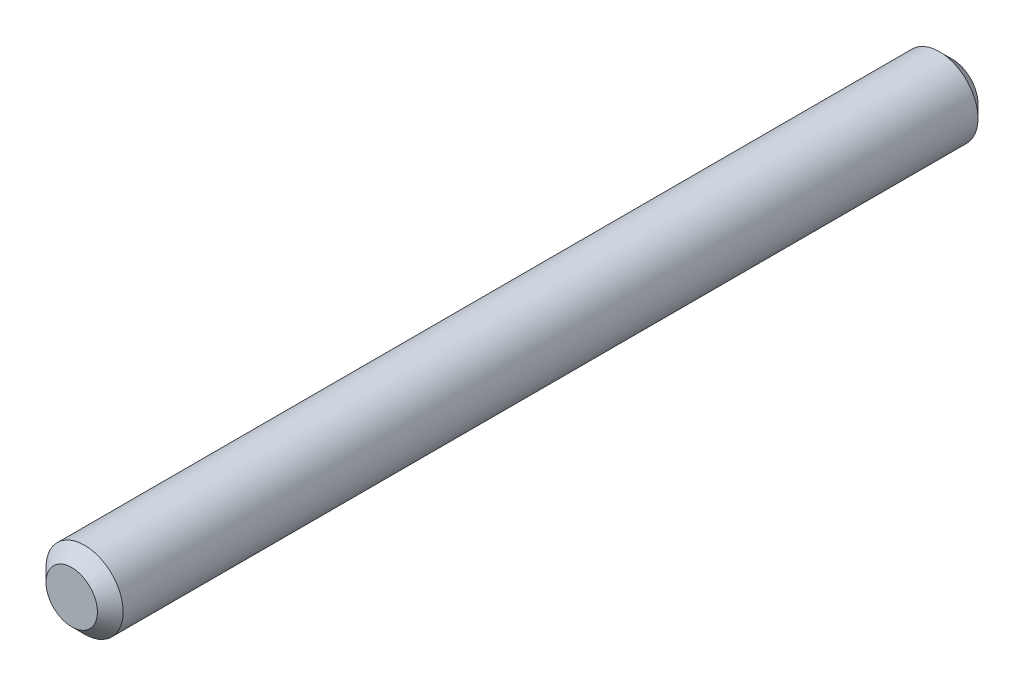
ISO-10303-21;
HEADER;
FILE_DESCRIPTION(('STEP AP214'),'2;1');
FILE_NAME('part.step','',(''),(''),'','','');
FILE_SCHEMA(('AUTOMOTIVE_DESIGN { 1 0 10303 214 1 1 1 1 }'));
ENDSEC;
DATA;
#1=APPLICATION_CONTEXT('core data for automotive mechanical design processes');
#2=APPLICATION_PROTOCOL_DEFINITION('international standard','automotive_design',2000,#1);
#3=PRODUCT_CONTEXT('',#1,'mechanical');
#4=PRODUCT('Part','Part','',(#3));
#5=PRODUCT_RELATED_PRODUCT_CATEGORY('part','',(#4));
#6=PRODUCT_DEFINITION_FORMATION('','',#4);
#7=PRODUCT_DEFINITION_CONTEXT('part definition',#1,'design');
#8=PRODUCT_DEFINITION('design','',#6,#7);
#9=PRODUCT_DEFINITION_SHAPE('','',#8);
#10=(LENGTH_UNIT() NAMED_UNIT(*) SI_UNIT(.MILLI.,.METRE.));
#11=(NAMED_UNIT(*) PLANE_ANGLE_UNIT() SI_UNIT($,.RADIAN.));
#12=(NAMED_UNIT(*) SI_UNIT($,.STERADIAN.) SOLID_ANGLE_UNIT());
#13=UNCERTAINTY_MEASURE_WITH_UNIT(LENGTH_MEASURE(1.E-05),#10,'distance_accuracy_value','');
#14=(GEOMETRIC_REPRESENTATION_CONTEXT(3) GLOBAL_UNCERTAINTY_ASSIGNED_CONTEXT((#13)) GLOBAL_UNIT_ASSIGNED_CONTEXT((#10,
#11,#12)) REPRESENTATION_CONTEXT('',''));
#15=CARTESIAN_POINT('',(0.,0.,0.));
#16=DIRECTION('',(0.,0.,1.));
#17=DIRECTION('',(1.,0.,0.));
#18=AXIS2_PLACEMENT_3D('',#15,#16,#17);
#19=CARTESIAN_POINT('',(0.,0.,34.25));
#20=DIRECTION('',(0.,0.,-1.));
#21=DIRECTION('',(-1.,0.,0.));
#22=AXIS2_PLACEMENT_3D('',#19,#20,#21);
#23=PLANE('',#22);
#24=CARTESIAN_POINT('',(0.,0.,34.2500000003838));
#25=DIRECTION('',(0.,0.,-1.));
#26=DIRECTION('',(-1.,0.,0.));
#27=AXIS2_PLACEMENT_3D('',#24,#25,#26);
#28=CIRCLE('',#27,2.0000000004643);
#29=CARTESIAN_POINT('',(-2.0000000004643,0.,34.2500000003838));
#30=VERTEX_POINT('',#29);
#31=EDGE_CURVE('E17',#30,#30,#28,.T.);
#32=ORIENTED_EDGE('',*,*,#31,.F.);
#33=EDGE_LOOP('',(#32));
#34=FACE_BOUND('',#33,.T.);
#35=ADVANCED_FACE('F14',(#34),#23,.F.);
#36=CARTESIAN_POINT('',(0.,0.,-34.25));
#37=DIRECTION('',(0.,0.,-1.));
#38=DIRECTION('',(-1.,0.,0.));
#39=AXIS2_PLACEMENT_3D('',#36,#37,#38);
#40=PLANE('',#39);
#41=CARTESIAN_POINT('',(0.,0.,-34.2500000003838));
#42=DIRECTION('',(0.,0.,1.));
#43=DIRECTION('',(1.,0.,0.));
#44=AXIS2_PLACEMENT_3D('',#41,#42,#43);
#45=CIRCLE('',#44,2.0000000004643);
#46=CARTESIAN_POINT('',(2.0000000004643,0.,-34.2500000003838));
#47=VERTEX_POINT('',#46);
#48=EDGE_CURVE('E29',#47,#47,#45,.T.);
#49=ORIENTED_EDGE('',*,*,#48,.F.);
#50=EDGE_LOOP('',(#49));
#51=FACE_BOUND('',#50,.T.);
#52=ADVANCED_FACE('F45',(#51),#40,.T.);
#53=CARTESIAN_POINT('',(0.,0.,33.249999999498));
#54=DIRECTION('',(0.,0.,-1.));
#55=DIRECTION('',(-1.,0.,0.));
#56=AXIS2_PLACEMENT_3D('',#53,#54,#55);
#57=CONICAL_SURFACE('',#56,2.999999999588,0.785398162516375);
#58=CARTESIAN_POINT('',(0.,0.,33.25));
#59=DIRECTION('',(0.,0.,1.));
#60=DIRECTION('',(1.,0.,0.));
#61=AXIS2_PLACEMENT_3D('',#58,#59,#60);
#62=CIRCLE('',#61,3.);
#63=CARTESIAN_POINT('',(3.,0.,33.25));
#64=VERTEX_POINT('',#63);
#65=EDGE_CURVE('E22',#64,#64,#62,.F.);
#66=ORIENTED_EDGE('',*,*,#65,.F.);
#67=EDGE_LOOP('',(#66));
#68=FACE_BOUND('',#67,.T.);
#69=ORIENTED_EDGE('',*,*,#31,.T.);
#70=EDGE_LOOP('',(#69));
#71=FACE_BOUND('',#70,.T.);
#72=ADVANCED_FACE('F42',(#68,#71),#57,.T.);
#73=CARTESIAN_POINT('',(0.,0.,-33.249999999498));
#74=DIRECTION('',(0.,0.,1.));
#75=DIRECTION('',(1.,0.,0.));
#76=AXIS2_PLACEMENT_3D('',#73,#74,#75);
#77=CONICAL_SURFACE('',#76,2.999999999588,0.785398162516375);
#78=CARTESIAN_POINT('',(0.,0.,-33.25));
#79=DIRECTION('',(0.,0.,1.));
#80=DIRECTION('',(1.,0.,0.));
#81=AXIS2_PLACEMENT_3D('',#78,#79,#80);
#82=CIRCLE('',#81,3.);
#83=CARTESIAN_POINT('',(3.,0.,-33.25));
#84=VERTEX_POINT('',#83);
#85=EDGE_CURVE('E10',#84,#84,#82,.T.);
#86=ORIENTED_EDGE('',*,*,#85,.F.);
#87=EDGE_LOOP('',(#86));
#88=FACE_BOUND('',#87,.T.);
#89=ORIENTED_EDGE('',*,*,#48,.T.);
#90=EDGE_LOOP('',(#89));
#91=FACE_BOUND('',#90,.T.);
#92=ADVANCED_FACE('F53',(#88,#91),#77,.T.);
#93=CARTESIAN_POINT('',(0.,0.,0.));
#94=DIRECTION('',(0.,0.,1.));
#95=DIRECTION('',(1.,0.,0.));
#96=AXIS2_PLACEMENT_3D('',#93,#94,#95);
#97=CYLINDRICAL_SURFACE('',#96,3.);
#98=ORIENTED_EDGE('',*,*,#85,.T.);
#99=EDGE_LOOP('',(#98));
#100=FACE_BOUND('',#99,.T.);
#101=ORIENTED_EDGE('',*,*,#65,.T.);
#102=EDGE_LOOP('',(#101));
#103=FACE_BOUND('',#102,.T.);
#104=ADVANCED_FACE('F51',(#100,#103),#97,.T.);
#105=CLOSED_SHELL('',(#35,#52,#72,#92,#104));
#106=MANIFOLD_SOLID_BREP('B1',#105);
#107=ADVANCED_BREP_SHAPE_REPRESENTATION('',(#18,#106),#14);
#108=SHAPE_DEFINITION_REPRESENTATION(#9,#107);
ENDSEC;
END-ISO-10303-21;
